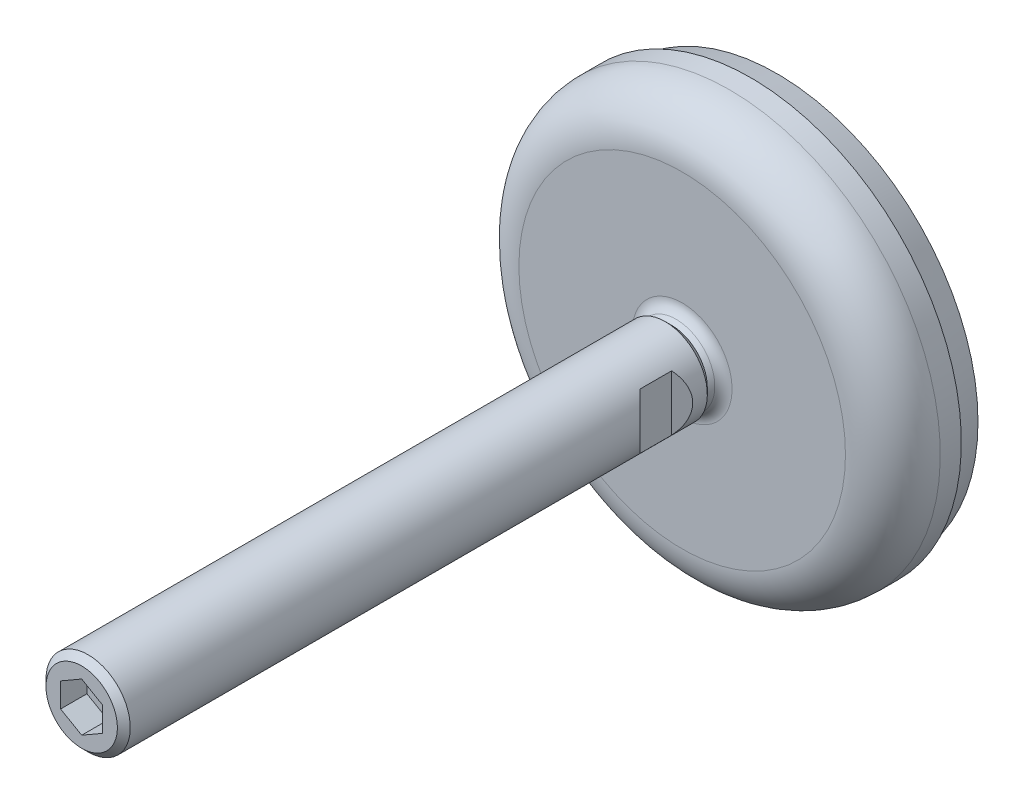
ISO-10303-21;
HEADER;
FILE_DESCRIPTION(('STEP AP214'),'2;1');
FILE_NAME('part.step','',(''),(''),'','','');
FILE_SCHEMA(('AUTOMOTIVE_DESIGN { 1 0 10303 214 1 1 1 1 }'));
ENDSEC;
DATA;
#1=APPLICATION_CONTEXT('core data for automotive mechanical design processes');
#2=APPLICATION_PROTOCOL_DEFINITION('international standard','automotive_design',2000,#1);
#3=PRODUCT_CONTEXT('',#1,'mechanical');
#4=PRODUCT('Part','Part','',(#3));
#5=PRODUCT_RELATED_PRODUCT_CATEGORY('part','',(#4));
#6=PRODUCT_DEFINITION_FORMATION('','',#4);
#7=PRODUCT_DEFINITION_CONTEXT('part definition',#1,'design');
#8=PRODUCT_DEFINITION('design','',#6,#7);
#9=PRODUCT_DEFINITION_SHAPE('','',#8);
#10=(LENGTH_UNIT() NAMED_UNIT(*) SI_UNIT(.MILLI.,.METRE.));
#11=(NAMED_UNIT(*) PLANE_ANGLE_UNIT() SI_UNIT($,.RADIAN.));
#12=(NAMED_UNIT(*) SI_UNIT($,.STERADIAN.) SOLID_ANGLE_UNIT());
#13=UNCERTAINTY_MEASURE_WITH_UNIT(LENGTH_MEASURE(1.E-05),#10,'distance_accuracy_value','');
#14=(GEOMETRIC_REPRESENTATION_CONTEXT(3) GLOBAL_UNCERTAINTY_ASSIGNED_CONTEXT((#13)) GLOBAL_UNIT_ASSIGNED_CONTEXT((#10,
#11,#12)) REPRESENTATION_CONTEXT('',''));
#15=CARTESIAN_POINT('',(0.,0.,0.));
#16=DIRECTION('',(0.,0.,1.));
#17=DIRECTION('',(1.,0.,0.));
#18=AXIS2_PLACEMENT_3D('',#15,#16,#17);
#19=CARTESIAN_POINT('',(0.,0.,21.227));
#20=DIRECTION('',(0.,0.,-1.));
#21=DIRECTION('',(-1.,0.,0.));
#22=AXIS2_PLACEMENT_3D('',#19,#20,#21);
#23=CYLINDRICAL_SURFACE('',#22,8.);
#24=DIRECTION('',(0.,0.,-1.));
#25=VECTOR('',#24,1.);
#26=CARTESIAN_POINT('',(6.,5.29150262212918,21.227));
#27=LINE('',#26,#25);
#28=CARTESIAN_POINT('',(6.,5.29150262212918,26.));
#29=VERTEX_POINT('',#28);
#30=CARTESIAN_POINT('',(6.,5.29150262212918,32.));
#31=VERTEX_POINT('',#30);
#32=EDGE_CURVE('E9',#29,#31,#27,.F.);
#33=ORIENTED_EDGE('',*,*,#32,.F.);
#34=CARTESIAN_POINT('',(0.,0.,32.));
#35=DIRECTION('',(-0.707106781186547,0.,-0.707106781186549));
#36=DIRECTION('',(0.707106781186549,0.,-0.707106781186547));
#37=AXIS2_PLACEMENT_3D('',#34,#35,#36);
#38=ELLIPSE('',#37,11.3137084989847,8.);
#39=CARTESIAN_POINT('',(6.,-5.29150262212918,26.));
#40=VERTEX_POINT('',#39);
#41=EDGE_CURVE('E215',#40,#29,#38,.F.);
#42=ORIENTED_EDGE('',*,*,#41,.F.);
#43=DIRECTION('',(0.,0.,-1.));
#44=VECTOR('',#43,1.);
#45=CARTESIAN_POINT('',(6.,-5.29150262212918,21.227));
#46=LINE('',#45,#44);
#47=CARTESIAN_POINT('',(6.,-5.29150262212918,32.));
#48=VERTEX_POINT('',#47);
#49=EDGE_CURVE('E217',#48,#40,#46,.T.);
#50=ORIENTED_EDGE('',*,*,#49,.F.);
#51=CARTESIAN_POINT('',(0.,0.,26.));
#52=DIRECTION('',(-0.707106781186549,0.,0.707106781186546));
#53=DIRECTION('',(-0.707106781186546,0.,-0.707106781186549));
#54=AXIS2_PLACEMENT_3D('',#51,#52,#53);
#55=ELLIPSE('',#54,11.3137084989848,8.);
#56=EDGE_CURVE('E22',#31,#48,#55,.F.);
#57=ORIENTED_EDGE('',*,*,#56,.F.);
#58=EDGE_LOOP('',(#33,#42,#50,#57));
#59=FACE_BOUND('',#58,.T.);
#60=DIRECTION('',(0.,0.,-1.));
#61=VECTOR('',#60,1.);
#62=CARTESIAN_POINT('',(-6.,-5.29150262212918,21.227));
#63=LINE('',#62,#61);
#64=CARTESIAN_POINT('',(-6.,-5.29150262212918,26.));
#65=VERTEX_POINT('',#64);
#66=CARTESIAN_POINT('',(-6.,-5.29150262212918,32.));
#67=VERTEX_POINT('',#66);
#68=EDGE_CURVE('E209',#65,#67,#63,.F.);
#69=ORIENTED_EDGE('',*,*,#68,.F.);
#70=CARTESIAN_POINT('',(0.,0.,32.));
#71=DIRECTION('',(0.707106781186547,0.,-0.707106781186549));
#72=DIRECTION('',(-0.707106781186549,0.,-0.707106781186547));
#73=AXIS2_PLACEMENT_3D('',#70,#71,#72);
#74=ELLIPSE('',#73,11.3137084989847,8.);
#75=CARTESIAN_POINT('',(-6.,5.29150262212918,26.));
#76=VERTEX_POINT('',#75);
#77=EDGE_CURVE('E212',#76,#65,#74,.F.);
#78=ORIENTED_EDGE('',*,*,#77,.F.);
#79=DIRECTION('',(0.,0.,-1.));
#80=VECTOR('',#79,1.);
#81=CARTESIAN_POINT('',(-6.,5.29150262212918,21.227));
#82=LINE('',#81,#80);
#83=CARTESIAN_POINT('',(-6.,5.29150262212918,32.));
#84=VERTEX_POINT('',#83);
#85=EDGE_CURVE('E186',#84,#76,#82,.T.);
#86=ORIENTED_EDGE('',*,*,#85,.F.);
#87=CARTESIAN_POINT('',(0.,0.,26.));
#88=DIRECTION('',(0.707106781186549,0.,0.707106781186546));
#89=DIRECTION('',(0.707106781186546,0.,-0.707106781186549));
#90=AXIS2_PLACEMENT_3D('',#87,#88,#89);
#91=ELLIPSE('',#90,11.3137084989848,8.);
#92=EDGE_CURVE('E183',#67,#84,#91,.F.);
#93=ORIENTED_EDGE('',*,*,#92,.F.);
#94=EDGE_LOOP('',(#69,#78,#86,#93));
#95=FACE_BOUND('',#94,.T.);
#96=CARTESIAN_POINT('',(0.,0.,130.773));
#97=DIRECTION('',(0.,0.,-1.));
#98=DIRECTION('',(0.,1.,0.));
#99=AXIS2_PLACEMENT_3D('',#96,#97,#98);
#100=CIRCLE('',#99,8.);
#101=CARTESIAN_POINT('',(0.,8.,130.773));
#102=VERTEX_POINT('',#101);
#103=EDGE_CURVE('E191',#102,#102,#100,.T.);
#104=ORIENTED_EDGE('',*,*,#103,.T.);
#105=EDGE_LOOP('',(#104));
#106=FACE_BOUND('',#105,.T.);
#107=CARTESIAN_POINT('',(0.,0.,21.227));
#108=DIRECTION('',(0.,0.,-1.));
#109=DIRECTION('',(0.,1.,0.));
#110=AXIS2_PLACEMENT_3D('',#107,#108,#109);
#111=CIRCLE('',#110,8.);
#112=CARTESIAN_POINT('',(0.,8.,21.227));
#113=VERTEX_POINT('',#112);
#114=EDGE_CURVE('E495',#113,#113,#111,.T.);
#115=ORIENTED_EDGE('',*,*,#114,.F.);
#116=EDGE_LOOP('',(#115));
#117=FACE_BOUND('',#116,.T.);
#118=ADVANCED_FACE('F14',(#59,#95,#106,#117),#23,.T.);
#119=CARTESIAN_POINT('',(0.,0.,20.));
#120=DIRECTION('',(0.,0.,1.));
#121=DIRECTION('',(1.,0.,0.));
#122=AXIS2_PLACEMENT_3D('',#119,#120,#121);
#123=CONICAL_SURFACE('',#122,6.773,0.785398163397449);
#124=ORIENTED_EDGE('',*,*,#114,.T.);
#125=EDGE_LOOP('',(#124));
#126=FACE_BOUND('',#125,.T.);
#127=CARTESIAN_POINT('',(0.,0.,20.));
#128=DIRECTION('',(0.,0.,-1.));
#129=DIRECTION('',(-1.,0.,0.));
#130=AXIS2_PLACEMENT_3D('',#127,#128,#129);
#131=CIRCLE('',#130,6.773);
#132=CARTESIAN_POINT('',(-6.773,0.,20.));
#133=VERTEX_POINT('',#132);
#134=EDGE_CURVE('E493',#133,#133,#131,.T.);
#135=ORIENTED_EDGE('',*,*,#134,.F.);
#136=EDGE_LOOP('',(#135));
#137=FACE_BOUND('',#136,.T.);
#138=ADVANCED_FACE('F388',(#126,#137),#123,.T.);
#139=CARTESIAN_POINT('',(1.93614044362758,0.,13.2805600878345));
#140=DIRECTION('',(0.,1.,0.));
#141=DIRECTION('',(-0.176012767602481,0.,-0.984387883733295));
#142=AXIS2_PLACEMENT_3D('',#139,#140,#141);
#143=CIRCLE('',#142,11.0000000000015);
#144=TRIMMED_CURVE('',#143,(PARAMETER_VALUE(0.)),(PARAMETER_VALUE(2.7877236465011)),.T.,.PARAMETER.);
#145=CARTESIAN_POINT('',(0.,0.,13.2805600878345));
#146=DIRECTION('',(0.,0.,-1.));
#147=AXIS1_PLACEMENT('',#145,#146);
#148=SURFACE_OF_REVOLUTION('',#144,#147);
#149=ORIENTED_EDGE('',*,*,#134,.T.);
#150=EDGE_LOOP('',(#149));
#151=FACE_BOUND('',#150,.T.);
#152=CARTESIAN_POINT('',(0.,0.,19.1630666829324));
#153=DIRECTION('',(0.,0.,-1.));
#154=DIRECTION('',(-1.,0.,0.));
#155=AXIS2_PLACEMENT_3D('',#152,#153,#154);
#156=CIRCLE('',#155,7.35881066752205);
#157=CARTESIAN_POINT('',(-7.35881066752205,0.,19.1630666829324));
#158=VERTEX_POINT('',#157);
#159=EDGE_CURVE('E203',#158,#158,#156,.T.);
#160=ORIENTED_EDGE('',*,*,#159,.F.);
#161=EDGE_LOOP('',(#160));
#162=FACE_BOUND('',#161,.T.);
#163=ADVANCED_FACE('F397',(#151,#162),#148,.F.);
#164=CARTESIAN_POINT('',(0.,0.,20.5));
#165=DIRECTION('',(0.,0.,-1.));
#166=DIRECTION('',(-1.,0.,0.));
#167=AXIS2_PLACEMENT_3D('',#164,#165,#166);
#168=TOROIDAL_SURFACE('',#167,9.47129955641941,2.5);
#169=CARTESIAN_POINT('',(0.,0.,18.));
#170=DIRECTION('',(0.,0.,-1.));
#171=DIRECTION('',(-1.,0.,0.));
#172=AXIS2_PLACEMENT_3D('',#169,#170,#171);
#173=CIRCLE('',#172,9.4712995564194);
#174=CARTESIAN_POINT('',(-9.4712995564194,0.,18.));
#175=VERTEX_POINT('',#174);
#176=EDGE_CURVE('E200',#175,#175,#173,.T.);
#177=ORIENTED_EDGE('',*,*,#176,.F.);
#178=EDGE_LOOP('',(#177));
#179=FACE_BOUND('',#178,.T.);
#180=ORIENTED_EDGE('',*,*,#159,.T.);
#181=EDGE_LOOP('',(#180));
#182=FACE_BOUND('',#181,.T.);
#183=ADVANCED_FACE('F407',(#179,#182),#168,.F.);
#184=CARTESIAN_POINT('',(-31.,31.,18.));
#185=CARTESIAN_POINT('',(-31.,-31.,18.));
#186=CARTESIAN_POINT('',(-31.,-31.62,18.));
#187=B_SPLINE_CURVE_WITH_KNOTS('',1,(#184,#185,#186),.UNSPECIFIED.,.F.,.F.,(2,1,2),(0.,1.,1.01),.UNSPECIFIED.);
#188=DIRECTION('',(1.,0.,0.));
#189=VECTOR('',#188,1.);
#190=SURFACE_OF_LINEAR_EXTRUSION('',#187,#189);
#191=ORIENTED_EDGE('',*,*,#176,.T.);
#192=EDGE_LOOP('',(#191));
#193=FACE_BOUND('',#192,.T.);
#194=CARTESIAN_POINT('',(0.,0.,18.));
#195=DIRECTION('',(0.,0.,-1.));
#196=DIRECTION('',(-1.,0.,0.));
#197=AXIS2_PLACEMENT_3D('',#194,#195,#196);
#198=CIRCLE('',#197,31.);
#199=CARTESIAN_POINT('',(-31.,0.,18.));
#200=VERTEX_POINT('',#199);
#201=EDGE_CURVE('E197',#200,#200,#198,.T.);
#202=ORIENTED_EDGE('',*,*,#201,.F.);
#203=EDGE_LOOP('',(#202));
#204=FACE_BOUND('',#203,.T.);
#205=ADVANCED_FACE('F415',(#193,#204),#190,.T.);
#206=CARTESIAN_POINT('',(0.,0.,9.));
#207=DIRECTION('',(0.,0.,-1.));
#208=DIRECTION('',(-1.,0.,0.));
#209=AXIS2_PLACEMENT_3D('',#206,#207,#208);
#210=TOROIDAL_SURFACE('',#209,31.,9.);
#211=ORIENTED_EDGE('',*,*,#201,.T.);
#212=EDGE_LOOP('',(#211));
#213=FACE_BOUND('',#212,.T.);
#214=CARTESIAN_POINT('',(0.,0.,9.));
#215=DIRECTION('',(0.,0.,-1.));
#216=DIRECTION('',(0.,1.,0.));
#217=AXIS2_PLACEMENT_3D('',#214,#215,#216);
#218=CIRCLE('',#217,40.);
#219=CARTESIAN_POINT('',(0.,40.,9.));
#220=VERTEX_POINT('',#219);
#221=EDGE_CURVE('E196',#220,#220,#218,.T.);
#222=ORIENTED_EDGE('',*,*,#221,.F.);
#223=EDGE_LOOP('',(#222));
#224=FACE_BOUND('',#223,.T.);
#225=ADVANCED_FACE('F420',(#213,#224),#210,.T.);
#226=CARTESIAN_POINT('',(0.,0.,5.));
#227=DIRECTION('',(0.,0.,-1.));
#228=DIRECTION('',(-1.,0.,0.));
#229=AXIS2_PLACEMENT_3D('',#226,#227,#228);
#230=CYLINDRICAL_SURFACE('',#229,40.);
#231=CARTESIAN_POINT('',(0.,0.,5.));
#232=DIRECTION('',(0.,0.,-1.));
#233=DIRECTION('',(-1.,0.,0.));
#234=AXIS2_PLACEMENT_3D('',#231,#232,#233);
#235=CIRCLE('',#234,40.);
#236=CARTESIAN_POINT('',(-40.,0.,5.));
#237=VERTEX_POINT('',#236);
#238=EDGE_CURVE('E188',#237,#237,#235,.T.);
#239=ORIENTED_EDGE('',*,*,#238,.F.);
#240=EDGE_LOOP('',(#239));
#241=FACE_BOUND('',#240,.T.);
#242=ORIENTED_EDGE('',*,*,#221,.T.);
#243=EDGE_LOOP('',(#242));
#244=FACE_BOUND('',#243,.T.);
#245=ADVANCED_FACE('F430',(#241,#244),#230,.T.);
#246=CARTESIAN_POINT('',(-40.4800021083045,-40.,5.));
#247=DIRECTION('',(0.,0.,-1.));
#248=DIRECTION('',(0.,1.,0.));
#249=AXIS2_PLACEMENT_3D('',#246,#247,#248);
#250=PLANE('',#249);
#251=CARTESIAN_POINT('',(0.,0.,5.));
#252=DIRECTION('',(0.,0.,1.));
#253=DIRECTION('',(1.,0.,0.));
#254=AXIS2_PLACEMENT_3D('',#251,#252,#253);
#255=CIRCLE('',#254,39.5);
#256=CARTESIAN_POINT('',(39.5,0.,5.));
#257=VERTEX_POINT('',#256);
#258=EDGE_CURVE('E179',#257,#257,#255,.F.);
#259=ORIENTED_EDGE('',*,*,#258,.F.);
#260=EDGE_LOOP('',(#259));
#261=FACE_BOUND('',#260,.T.);
#262=ORIENTED_EDGE('',*,*,#238,.T.);
#263=EDGE_LOOP('',(#262));
#264=FACE_BOUND('',#263,.T.);
#265=ADVANCED_FACE('F174',(#261,#264),#250,.T.);
#266=CARTESIAN_POINT('',(-38.6181791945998,-38.1602540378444,0.));
#267=DIRECTION('',(0.,0.,-1.));
#268=DIRECTION('',(0.,1.,0.));
#269=AXIS2_PLACEMENT_3D('',#266,#267,#268);
#270=PLANE('',#269);
#271=CARTESIAN_POINT('',(0.,0.,0.));
#272=DIRECTION('',(0.,0.,1.));
#273=DIRECTION('',(1.,0.,0.));
#274=AXIS2_PLACEMENT_3D('',#271,#272,#273);
#275=CIRCLE('',#274,38.1602540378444);
#276=CARTESIAN_POINT('',(38.1602540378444,0.,0.));
#277=VERTEX_POINT('',#276);
#278=EDGE_CURVE('E182',#277,#277,#275,.T.);
#279=ORIENTED_EDGE('',*,*,#278,.F.);
#280=EDGE_LOOP('',(#279));
#281=FACE_BOUND('',#280,.T.);
#282=ADVANCED_FACE('F165',(#281),#270,.T.);
#283=CARTESIAN_POINT('',(0.,0.,0.));
#284=DIRECTION('',(0.,0.,1.));
#285=DIRECTION('',(1.,0.,0.));
#286=AXIS2_PLACEMENT_3D('',#283,#284,#285);
#287=CONICAL_SURFACE('',#286,38.1602540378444,0.26179938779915);
#288=ORIENTED_EDGE('',*,*,#258,.T.);
#289=EDGE_LOOP('',(#288));
#290=FACE_BOUND('',#289,.T.);
#291=ORIENTED_EDGE('',*,*,#278,.T.);
#292=EDGE_LOOP('',(#291));
#293=FACE_BOUND('',#292,.T.);
#294=ADVANCED_FACE('F16',(#290,#293),#287,.T.);
#295=CARTESIAN_POINT('',(-4.,-4.67422777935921,127.));
#296=DIRECTION('',(0.,0.,1.));
#297=DIRECTION('',(1.,0.,0.));
#298=AXIS2_PLACEMENT_3D('',#295,#296,#297);
#299=PLANE('',#298);
#300=DIRECTION('',(0.866025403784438,0.5,0.));
#301=VECTOR('',#300,1.);
#302=CARTESIAN_POINT('',(-2.,3.46410161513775,127.));
#303=LINE('',#302,#301);
#304=CARTESIAN_POINT('',(-4.,2.3094010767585,127.));
#305=VERTEX_POINT('',#304);
#306=CARTESIAN_POINT('',(1.08254330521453E-07,4.61880209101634,127.));
#307=VERTEX_POINT('',#306);
#308=EDGE_CURVE('E138',#305,#307,#303,.T.);
#309=ORIENTED_EDGE('',*,*,#308,.F.);
#310=DIRECTION('',(0.,1.,0.));
#311=VECTOR('',#310,1.);
#312=CARTESIAN_POINT('',(-4.,0.,127.));
#313=LINE('',#312,#311);
#314=CARTESIAN_POINT('',(-4.,-2.3094010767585,127.));
#315=VERTEX_POINT('',#314);
#316=EDGE_CURVE('E72',#315,#305,#313,.T.);
#317=ORIENTED_EDGE('',*,*,#316,.F.);
#318=DIRECTION('',(-0.866025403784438,0.5,0.));
#319=VECTOR('',#318,1.);
#320=CARTESIAN_POINT('',(-2.,-3.46410161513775,127.));
#321=LINE('',#320,#319);
#322=CARTESIAN_POINT('',(-2.16508660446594E-07,-4.61880202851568,127.));
#323=VERTEX_POINT('',#322);
#324=EDGE_CURVE('E68',#323,#315,#321,.T.);
#325=ORIENTED_EDGE('',*,*,#324,.F.);
#326=DIRECTION('',(-0.866025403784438,-0.5,0.));
#327=VECTOR('',#326,1.);
#328=CARTESIAN_POINT('',(2.,-3.46410161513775,127.));
#329=LINE('',#328,#327);
#330=CARTESIAN_POINT('',(4.,-2.3094010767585,127.));
#331=VERTEX_POINT('',#330);
#332=EDGE_CURVE('E91',#331,#323,#329,.T.);
#333=ORIENTED_EDGE('',*,*,#332,.F.);
#334=DIRECTION('',(0.,-1.,0.));
#335=VECTOR('',#334,1.);
#336=CARTESIAN_POINT('',(4.,0.,127.));
#337=LINE('',#336,#335);
#338=CARTESIAN_POINT('',(4.,2.3094010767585,127.));
#339=VERTEX_POINT('',#338);
#340=EDGE_CURVE('E149',#339,#331,#337,.T.);
#341=ORIENTED_EDGE('',*,*,#340,.F.);
#342=DIRECTION('',(0.866025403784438,-0.5,0.));
#343=VECTOR('',#342,1.);
#344=CARTESIAN_POINT('',(2.,3.46410161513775,127.));
#345=LINE('',#344,#343);
#346=EDGE_CURVE('E142',#307,#339,#345,.T.);
#347=ORIENTED_EDGE('',*,*,#346,.F.);
#348=EDGE_LOOP('',(#309,#317,#325,#333,#341,#347));
#349=FACE_BOUND('',#348,.T.);
#350=ADVANCED_FACE('F164',(#349),#299,.T.);
#351=CARTESIAN_POINT('',(4.,2.3094010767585,132.));
#352=DIRECTION('',(-0.5,-0.866025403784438,0.));
#353=DIRECTION('',(-0.866025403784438,0.5,0.));
#354=AXIS2_PLACEMENT_3D('',#351,#352,#353);
#355=PLANE('',#354);
#356=ORIENTED_EDGE('',*,*,#346,.T.);
#357=DIRECTION('',(0.,0.,-1.));
#358=VECTOR('',#357,1.);
#359=CARTESIAN_POINT('',(4.,2.3094010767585,132.));
#360=LINE('',#359,#358);
#361=CARTESIAN_POINT('',(4.,2.3094010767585,132.));
#362=VERTEX_POINT('',#361);
#363=EDGE_CURVE('E146',#362,#339,#360,.T.);
#364=ORIENTED_EDGE('',*,*,#363,.F.);
#365=CARTESIAN_POINT('',(0.,4.61880215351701,132.));
#366=CARTESIAN_POINT('',(0.166666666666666,4.52257710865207,132.));
#367=CARTESIAN_POINT('',(0.333333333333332,4.42635206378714,132.));
#368=CARTESIAN_POINT('',(0.666666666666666,4.23390197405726,132.));
#369=CARTESIAN_POINT('',(0.833333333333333,4.13767692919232,132.));
#370=CARTESIAN_POINT('',(1.16666666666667,3.94522683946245,132.));
#371=CARTESIAN_POINT('',(1.33333333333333,3.84900179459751,132.));
#372=CARTESIAN_POINT('',(1.66666666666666,3.65655170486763,132.));
#373=CARTESIAN_POINT('',(1.83333333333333,3.56032666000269,132.));
#374=CARTESIAN_POINT('',(2.16666666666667,3.36787657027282,132.));
#375=CARTESIAN_POINT('',(2.33333333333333,3.27165152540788,132.));
#376=CARTESIAN_POINT('',(2.66666666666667,3.079201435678,132.));
#377=CARTESIAN_POINT('',(2.83333333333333,2.98297639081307,132.));
#378=CARTESIAN_POINT('',(3.16666666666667,2.79052630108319,132.));
#379=CARTESIAN_POINT('',(3.33333333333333,2.69430125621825,132.));
#380=CARTESIAN_POINT('',(3.66666666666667,2.50185116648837,132.));
#381=CARTESIAN_POINT('',(3.83333333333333,2.40562612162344,132.));
#382=CARTESIAN_POINT('',(4.,2.3094010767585,132.));
#383=B_SPLINE_CURVE_WITH_KNOTS('',3,(#365,#366,#367,#368,#369,#370,#371,#372,#373,#374,#375,
#376,#377,#378,#379,#380,#381,#382),.UNSPECIFIED.,.F.,.F.,(4,2,2,2,2,2,2,2,4),(0.,
0.577350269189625,1.15470053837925,1.73205080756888,2.3094010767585,2.88675134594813,
3.46410161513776,4.04145188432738,4.61880215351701),.UNSPECIFIED.);
#384=CARTESIAN_POINT('',(-6.2517199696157E-08,4.61880211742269,132.));
#385=VERTEX_POINT('',#384);
#386=EDGE_CURVE('E120',#385,#362,#383,.T.);
#387=ORIENTED_EDGE('',*,*,#386,.F.);
#388=DIRECTION('',(0.,0.,-1.));
#389=VECTOR('',#388,1.);
#390=CARTESIAN_POINT('',(0.,4.61880215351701,132.));
#391=LINE('',#390,#389);
#392=EDGE_CURVE('E135',#385,#307,#391,.T.);
#393=ORIENTED_EDGE('',*,*,#392,.T.);
#394=EDGE_LOOP('',(#356,#364,#387,#393));
#395=FACE_BOUND('',#394,.T.);
#396=ADVANCED_FACE('F144',(#395),#355,.T.);
#397=CARTESIAN_POINT('',(0.,4.61880215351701,132.));
#398=DIRECTION('',(0.5,-0.866025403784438,0.));
#399=DIRECTION('',(-0.866025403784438,-0.5,0.));
#400=AXIS2_PLACEMENT_3D('',#397,#398,#399);
#401=PLANE('',#400);
#402=ORIENTED_EDGE('',*,*,#308,.T.);
#403=ORIENTED_EDGE('',*,*,#392,.F.);
#404=CARTESIAN_POINT('',(-4.,2.3094010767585,132.));
#405=CARTESIAN_POINT('',(-3.83333333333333,2.40562612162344,132.));
#406=CARTESIAN_POINT('',(-3.66666666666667,2.50185116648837,132.));
#407=CARTESIAN_POINT('',(-3.33333333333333,2.69430125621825,132.));
#408=CARTESIAN_POINT('',(-3.16666666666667,2.79052630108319,132.));
#409=CARTESIAN_POINT('',(-2.83333333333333,2.98297639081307,132.));
#410=CARTESIAN_POINT('',(-2.66666666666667,3.079201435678,132.));
#411=CARTESIAN_POINT('',(-2.33333333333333,3.27165152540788,132.));
#412=CARTESIAN_POINT('',(-2.16666666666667,3.36787657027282,132.));
#413=CARTESIAN_POINT('',(-1.83333333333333,3.56032666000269,132.));
#414=CARTESIAN_POINT('',(-1.66666666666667,3.65655170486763,132.));
#415=CARTESIAN_POINT('',(-1.33333333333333,3.84900179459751,132.));
#416=CARTESIAN_POINT('',(-1.16666666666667,3.94522683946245,132.));
#417=CARTESIAN_POINT('',(-0.833333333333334,4.13767692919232,132.));
#418=CARTESIAN_POINT('',(-0.666666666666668,4.23390197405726,132.));
#419=CARTESIAN_POINT('',(-0.333333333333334,4.42635206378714,132.));
#420=CARTESIAN_POINT('',(-0.166666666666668,4.52257710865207,132.));
#421=CARTESIAN_POINT('',(0.,4.61880215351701,132.));
#422=B_SPLINE_CURVE_WITH_KNOTS('',3,(#404,#405,#406,#407,#408,#409,#410,#411,#412,#413,#414,
#415,#416,#417,#418,#419,#420,#421),.UNSPECIFIED.,.F.,.F.,(4,2,2,2,2,2,2,2,4),(0.,
0.577350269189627,1.15470053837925,1.73205080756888,2.3094010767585,2.88675134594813,
3.46410161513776,4.04145188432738,4.61880215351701),.UNSPECIFIED.);
#423=CARTESIAN_POINT('',(-4.,2.3094010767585,132.));
#424=VERTEX_POINT('',#423);
#425=EDGE_CURVE('E82',#424,#385,#422,.T.);
#426=ORIENTED_EDGE('',*,*,#425,.F.);
#427=DIRECTION('',(0.,0.,-1.));
#428=VECTOR('',#427,1.);
#429=CARTESIAN_POINT('',(-4.,2.3094010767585,132.));
#430=LINE('',#429,#428);
#431=EDGE_CURVE('E78',#424,#305,#430,.T.);
#432=ORIENTED_EDGE('',*,*,#431,.T.);
#433=EDGE_LOOP('',(#402,#403,#426,#432));
#434=FACE_BOUND('',#433,.T.);
#435=ADVANCED_FACE('F132',(#434),#401,.T.);
#436=CARTESIAN_POINT('',(-4.,2.3094010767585,132.));
#437=DIRECTION('',(1.,0.,0.));
#438=DIRECTION('',(0.,-1.,0.));
#439=AXIS2_PLACEMENT_3D('',#436,#437,#438);
#440=PLANE('',#439);
#441=ORIENTED_EDGE('',*,*,#316,.T.);
#442=ORIENTED_EDGE('',*,*,#431,.F.);
#443=DIRECTION('',(0.,1.,0.));
#444=VECTOR('',#443,1.);
#445=CARTESIAN_POINT('',(-4.,0.,132.));
#446=LINE('',#445,#444);
#447=CARTESIAN_POINT('',(-4.,-2.3094010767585,132.));
#448=VERTEX_POINT('',#447);
#449=EDGE_CURVE('E75',#448,#424,#446,.T.);
#450=ORIENTED_EDGE('',*,*,#449,.F.);
#451=DIRECTION('',(0.,0.,-1.));
#452=VECTOR('',#451,1.);
#453=CARTESIAN_POINT('',(-4.,-2.3094010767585,132.));
#454=LINE('',#453,#452);
#455=EDGE_CURVE('E59',#448,#315,#454,.T.);
#456=ORIENTED_EDGE('',*,*,#455,.T.);
#457=EDGE_LOOP('',(#441,#442,#450,#456));
#458=FACE_BOUND('',#457,.T.);
#459=ADVANCED_FACE('F76',(#458),#440,.T.);
#460=CARTESIAN_POINT('',(-4.,-2.3094010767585,132.));
#461=DIRECTION('',(0.5,0.866025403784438,0.));
#462=DIRECTION('',(0.866025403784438,-0.5,0.));
#463=AXIS2_PLACEMENT_3D('',#460,#461,#462);
#464=PLANE('',#463);
#465=ORIENTED_EDGE('',*,*,#324,.T.);
#466=ORIENTED_EDGE('',*,*,#455,.F.);
#467=CARTESIAN_POINT('',(0.,-4.61880215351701,132.));
#468=CARTESIAN_POINT('',(-0.166666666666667,-4.52257710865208,132.));
#469=CARTESIAN_POINT('',(-0.333333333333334,-4.42635206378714,132.));
#470=CARTESIAN_POINT('',(-0.666666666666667,-4.23390197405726,132.));
#471=CARTESIAN_POINT('',(-0.833333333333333,-4.13767692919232,132.));
#472=CARTESIAN_POINT('',(-1.16666666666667,-3.94522683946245,132.));
#473=CARTESIAN_POINT('',(-1.33333333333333,-3.84900179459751,132.));
#474=CARTESIAN_POINT('',(-1.66666666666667,-3.65655170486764,132.));
#475=CARTESIAN_POINT('',(-1.83333333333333,-3.5603266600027,132.));
#476=CARTESIAN_POINT('',(-2.16666666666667,-3.36787657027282,132.));
#477=CARTESIAN_POINT('',(-2.33333333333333,-3.27165152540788,132.));
#478=CARTESIAN_POINT('',(-2.66666666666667,-3.07920143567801,132.));
#479=CARTESIAN_POINT('',(-2.83333333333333,-2.98297639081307,132.));
#480=CARTESIAN_POINT('',(-3.16666666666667,-2.7905263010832,132.));
#481=CARTESIAN_POINT('',(-3.33333333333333,-2.69430125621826,132.));
#482=CARTESIAN_POINT('',(-3.66666666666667,-2.50185116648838,132.));
#483=CARTESIAN_POINT('',(-3.83333333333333,-2.40562612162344,132.));
#484=CARTESIAN_POINT('',(-4.,-2.30940107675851,132.));
#485=B_SPLINE_CURVE_WITH_KNOTS('',3,(#467,#468,#469,#470,#471,#472,#473,#474,#475,#476,#477,
#478,#479,#480,#481,#482,#483,#484),.UNSPECIFIED.,.F.,.F.,(4,2,2,2,2,2,2,2,4),(0.,
0.577350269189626,1.15470053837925,1.73205080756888,2.3094010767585,2.88675134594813,
3.46410161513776,4.04145188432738,4.61880215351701),.UNSPECIFIED.);
#486=CARTESIAN_POINT('',(-6.25172003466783E-08,-4.61880211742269,132.));
#487=VERTEX_POINT('',#486);
#488=EDGE_CURVE('E64',#487,#448,#485,.T.);
#489=ORIENTED_EDGE('',*,*,#488,.F.);
#490=DIRECTION('',(0.,0.,-1.));
#491=VECTOR('',#490,1.);
#492=CARTESIAN_POINT('',(0.,-4.61880215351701,132.));
#493=LINE('',#492,#491);
#494=EDGE_CURVE('E89',#323,#487,#493,.F.);
#495=ORIENTED_EDGE('',*,*,#494,.F.);
#496=EDGE_LOOP('',(#465,#466,#489,#495));
#497=FACE_BOUND('',#496,.T.);
#498=ADVANCED_FACE('F61',(#497),#464,.T.);
#499=CARTESIAN_POINT('',(0.,-4.61880215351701,132.));
#500=DIRECTION('',(-0.5,0.866025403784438,0.));
#501=DIRECTION('',(0.866025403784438,0.5,0.));
#502=AXIS2_PLACEMENT_3D('',#499,#500,#501);
#503=PLANE('',#502);
#504=ORIENTED_EDGE('',*,*,#332,.T.);
#505=ORIENTED_EDGE('',*,*,#494,.T.);
#506=CARTESIAN_POINT('',(4.,-2.30940107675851,132.));
#507=CARTESIAN_POINT('',(3.83333333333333,-2.40562612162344,132.));
#508=CARTESIAN_POINT('',(3.66666666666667,-2.50185116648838,132.));
#509=CARTESIAN_POINT('',(3.33333333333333,-2.69430125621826,132.));
#510=CARTESIAN_POINT('',(3.16666666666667,-2.7905263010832,132.));
#511=CARTESIAN_POINT('',(2.83333333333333,-2.98297639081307,132.));
#512=CARTESIAN_POINT('',(2.66666666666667,-3.07920143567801,132.));
#513=CARTESIAN_POINT('',(2.33333333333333,-3.27165152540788,132.));
#514=CARTESIAN_POINT('',(2.16666666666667,-3.36787657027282,132.));
#515=CARTESIAN_POINT('',(1.83333333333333,-3.5603266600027,132.));
#516=CARTESIAN_POINT('',(1.66666666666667,-3.65655170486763,132.));
#517=CARTESIAN_POINT('',(1.33333333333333,-3.84900179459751,132.));
#518=CARTESIAN_POINT('',(1.16666666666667,-3.94522683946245,132.));
#519=CARTESIAN_POINT('',(0.833333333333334,-4.13767692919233,132.));
#520=CARTESIAN_POINT('',(0.666666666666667,-4.23390197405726,132.));
#521=CARTESIAN_POINT('',(0.333333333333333,-4.42635206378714,132.));
#522=CARTESIAN_POINT('',(0.166666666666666,-4.52257710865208,132.));
#523=CARTESIAN_POINT('',(0.,-4.61880215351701,132.));
#524=B_SPLINE_CURVE_WITH_KNOTS('',3,(#506,#507,#508,#509,#510,#511,#512,#513,#514,#515,#516,
#517,#518,#519,#520,#521,#522,#523),.UNSPECIFIED.,.F.,.F.,(4,2,2,2,2,2,2,2,4),(0.,
0.577350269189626,1.15470053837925,1.73205080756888,2.3094010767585,2.88675134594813,
3.46410161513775,4.04145188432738,4.61880215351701),.UNSPECIFIED.);
#525=CARTESIAN_POINT('',(4.,-2.3094010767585,132.));
#526=VERTEX_POINT('',#525);
#527=EDGE_CURVE('E88',#526,#487,#524,.T.);
#528=ORIENTED_EDGE('',*,*,#527,.F.);
#529=DIRECTION('',(0.,0.,-1.));
#530=VECTOR('',#529,1.);
#531=CARTESIAN_POINT('',(4.,-2.3094010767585,132.));
#532=LINE('',#531,#530);
#533=EDGE_CURVE('E37',#526,#331,#532,.T.);
#534=ORIENTED_EDGE('',*,*,#533,.T.);
#535=EDGE_LOOP('',(#504,#505,#528,#534));
#536=FACE_BOUND('',#535,.T.);
#537=ADVANCED_FACE('F111',(#536),#503,.T.);
#538=CARTESIAN_POINT('',(4.,-2.3094010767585,132.));
#539=DIRECTION('',(-1.,0.,0.));
#540=DIRECTION('',(0.,1.,0.));
#541=AXIS2_PLACEMENT_3D('',#538,#539,#540);
#542=PLANE('',#541);
#543=ORIENTED_EDGE('',*,*,#340,.T.);
#544=ORIENTED_EDGE('',*,*,#533,.F.);
#545=DIRECTION('',(0.,-1.,0.));
#546=VECTOR('',#545,1.);
#547=CARTESIAN_POINT('',(4.,0.,132.));
#548=LINE('',#547,#546);
#549=EDGE_CURVE('E123',#362,#526,#548,.T.);
#550=ORIENTED_EDGE('',*,*,#549,.F.);
#551=ORIENTED_EDGE('',*,*,#363,.T.);
#552=EDGE_LOOP('',(#543,#544,#550,#551));
#553=FACE_BOUND('',#552,.T.);
#554=ADVANCED_FACE('F151',(#553),#542,.T.);
#555=CARTESIAN_POINT('',(-6.85427810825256,6.773,132.));
#556=DIRECTION('',(0.,0.,1.));
#557=DIRECTION('',(0.,-1.,0.));
#558=AXIS2_PLACEMENT_3D('',#555,#556,#557);
#559=PLANE('',#558);
#560=ORIENTED_EDGE('',*,*,#549,.T.);
#561=ORIENTED_EDGE('',*,*,#527,.T.);
#562=ORIENTED_EDGE('',*,*,#488,.T.);
#563=ORIENTED_EDGE('',*,*,#449,.T.);
#564=ORIENTED_EDGE('',*,*,#425,.T.);
#565=ORIENTED_EDGE('',*,*,#386,.T.);
#566=EDGE_LOOP('',(#560,#561,#562,#563,#564,#565));
#567=FACE_BOUND('',#566,.T.);
#568=CARTESIAN_POINT('',(0.,0.,132.));
#569=DIRECTION('',(0.,0.,-1.));
#570=DIRECTION('',(-1.,0.,0.));
#571=AXIS2_PLACEMENT_3D('',#568,#569,#570);
#572=CIRCLE('',#571,6.773);
#573=CARTESIAN_POINT('',(-6.773,0.,132.));
#574=VERTEX_POINT('',#573);
#575=EDGE_CURVE('E204',#574,#574,#572,.T.);
#576=ORIENTED_EDGE('',*,*,#575,.F.);
#577=EDGE_LOOP('',(#576));
#578=FACE_BOUND('',#577,.T.);
#579=ADVANCED_FACE('F86',(#567,#578),#559,.T.);
#580=CARTESIAN_POINT('',(0.,0.,132.));
#581=DIRECTION('',(0.,0.,-1.));
#582=DIRECTION('',(-1.,0.,0.));
#583=AXIS2_PLACEMENT_3D('',#580,#581,#582);
#584=CONICAL_SURFACE('',#583,6.773,0.785398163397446);
#585=ORIENTED_EDGE('',*,*,#103,.F.);
#586=EDGE_LOOP('',(#585));
#587=FACE_BOUND('',#586,.T.);
#588=ORIENTED_EDGE('',*,*,#575,.T.);
#589=EDGE_LOOP('',(#588));
#590=FACE_BOUND('',#589,.T.);
#591=ADVANCED_FACE('F160',(#587,#590),#584,.T.);
#592=CARTESIAN_POINT('',(-8.,-10.,24.));
#593=DIRECTION('',(0.707106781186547,0.,-0.707106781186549));
#594=DIRECTION('',(-0.707106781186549,0.,-0.707106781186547));
#595=AXIS2_PLACEMENT_3D('',#592,#593,#594);
#596=PLANE('',#595);
#597=ORIENTED_EDGE('',*,*,#77,.T.);
#598=DIRECTION('',(0.,1.,0.));
#599=VECTOR('',#598,1.);
#600=CARTESIAN_POINT('',(-6.,-10.,26.));
#601=LINE('',#600,#599);
#602=EDGE_CURVE('E242',#65,#76,#601,.T.);
#603=ORIENTED_EDGE('',*,*,#602,.T.);
#604=EDGE_LOOP('',(#597,#603));
#605=FACE_BOUND('',#604,.T.);
#606=ADVANCED_FACE('F286',(#605),#596,.F.);
#607=CARTESIAN_POINT('',(-6.,-10.,26.));
#608=DIRECTION('',(1.,0.,0.));
#609=DIRECTION('',(0.,0.,-1.));
#610=AXIS2_PLACEMENT_3D('',#607,#608,#609);
#611=PLANE('',#610);
#612=ORIENTED_EDGE('',*,*,#68,.T.);
#613=DIRECTION('',(0.,1.,0.));
#614=VECTOR('',#613,1.);
#615=CARTESIAN_POINT('',(-6.,-10.,32.));
#616=LINE('',#615,#614);
#617=EDGE_CURVE('E235',#67,#84,#616,.T.);
#618=ORIENTED_EDGE('',*,*,#617,.T.);
#619=ORIENTED_EDGE('',*,*,#85,.T.);
#620=ORIENTED_EDGE('',*,*,#602,.F.);
#621=EDGE_LOOP('',(#612,#618,#619,#620));
#622=FACE_BOUND('',#621,.T.);
#623=ADVANCED_FACE('F276',(#622),#611,.F.);
#624=CARTESIAN_POINT('',(-6.,-10.,32.));
#625=DIRECTION('',(0.707106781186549,0.,0.707106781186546));
#626=DIRECTION('',(0.707106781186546,0.,-0.707106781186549));
#627=AXIS2_PLACEMENT_3D('',#624,#625,#626);
#628=PLANE('',#627);
#629=ORIENTED_EDGE('',*,*,#617,.F.);
#630=ORIENTED_EDGE('',*,*,#92,.T.);
#631=EDGE_LOOP('',(#629,#630));
#632=FACE_BOUND('',#631,.T.);
#633=ADVANCED_FACE('F277',(#632),#628,.F.);
#634=CARTESIAN_POINT('',(6.,-10.,32.));
#635=DIRECTION('',(-0.707106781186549,0.,0.707106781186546));
#636=DIRECTION('',(0.707106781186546,0.,0.707106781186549));
#637=AXIS2_PLACEMENT_3D('',#634,#635,#636);
#638=PLANE('',#637);
#639=DIRECTION('',(0.,1.,0.));
#640=VECTOR('',#639,1.);
#641=CARTESIAN_POINT('',(6.,-10.,32.));
#642=LINE('',#641,#640);
#643=EDGE_CURVE('E226',#48,#31,#642,.T.);
#644=ORIENTED_EDGE('',*,*,#643,.T.);
#645=ORIENTED_EDGE('',*,*,#56,.T.);
#646=EDGE_LOOP('',(#644,#645));
#647=FACE_BOUND('',#646,.T.);
#648=ADVANCED_FACE('F224',(#647),#638,.F.);
#649=CARTESIAN_POINT('',(6.,-10.,26.));
#650=DIRECTION('',(-1.,0.,0.));
#651=DIRECTION('',(0.,0.,1.));
#652=AXIS2_PLACEMENT_3D('',#649,#650,#651);
#653=PLANE('',#652);
#654=ORIENTED_EDGE('',*,*,#32,.T.);
#655=ORIENTED_EDGE('',*,*,#643,.F.);
#656=ORIENTED_EDGE('',*,*,#49,.T.);
#657=DIRECTION('',(0.,1.,0.));
#658=VECTOR('',#657,1.);
#659=CARTESIAN_POINT('',(6.,-10.,26.));
#660=LINE('',#659,#658);
#661=EDGE_CURVE('E28',#40,#29,#660,.T.);
#662=ORIENTED_EDGE('',*,*,#661,.T.);
#663=EDGE_LOOP('',(#654,#655,#656,#662));
#664=FACE_BOUND('',#663,.T.);
#665=ADVANCED_FACE('F233',(#664),#653,.F.);
#666=CARTESIAN_POINT('',(8.,-10.,24.));
#667=DIRECTION('',(-0.707106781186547,0.,-0.707106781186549));
#668=DIRECTION('',(-0.707106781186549,0.,0.707106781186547));
#669=AXIS2_PLACEMENT_3D('',#666,#667,#668);
#670=PLANE('',#669);
#671=ORIENTED_EDGE('',*,*,#41,.T.);
#672=ORIENTED_EDGE('',*,*,#661,.F.);
#673=EDGE_LOOP('',(#671,#672));
#674=FACE_BOUND('',#673,.T.);
#675=ADVANCED_FACE('F238',(#674),#670,.F.);
#676=CLOSED_SHELL('',(#118,#138,#163,#183,#205,#225,#245,#265,#282,#294,#350,#396,#435,#459,
#498,#537,#554,#579,#591,#606,#623,#633,#648,#665,#675));
#677=MANIFOLD_SOLID_BREP('B1',#676);
#678=ADVANCED_BREP_SHAPE_REPRESENTATION('',(#18,#677),#14);
#679=SHAPE_DEFINITION_REPRESENTATION(#9,#678);
ENDSEC;
END-ISO-10303-21;
